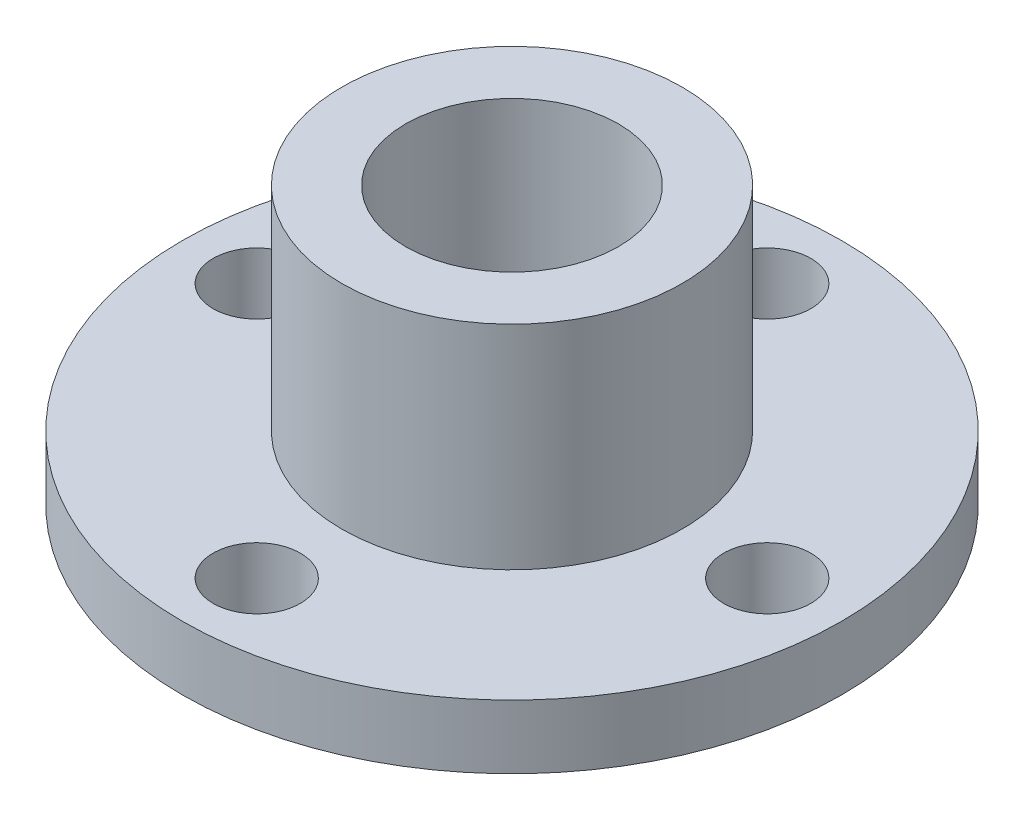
from build123d import *

# Parameters (mm, degrees)
SKETCH1_R           = 15.5
SKETCH1_R_2         = 5
SKETCH1_R_3         = 2.05
BOSS_EXTRUDE1_DEPTH = 3
SKETCH2_R           = 8
SKETCH2_R_2         = 5.003190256
BOSS_EXTRUDE2_DEPTH = 10


with BuildPart() as part:
    # Sketch1 → Boss-Extrude1 (new body)
    with BuildSketch(Plane(origin=(0, 0, 0), x_dir=(1, 0, 0), z_dir=(0, 1, 0))):
        with Locations(Location((0, 0, 0), (0, 0, 270))):
            Circle(SKETCH1_R)
        with Locations(Location((0, 0, 0), (0, 0, 270))):
            Circle(SKETCH1_R_2, mode=Mode.SUBTRACT)
        with Locations(Location((0, 12, 0), (0, 0, 270))):
            Circle(SKETCH1_R_3, mode=Mode.SUBTRACT)
        with Locations(Location((12, 0, 0), (0, 0, 270))):
            Circle(SKETCH1_R_3, mode=Mode.SUBTRACT)
        with Locations(Location((0, -12, 0), (0, 0, 270))):
            Circle(SKETCH1_R_3, mode=Mode.SUBTRACT)
        with Locations(Location((-12, 0, 0), (0, 0, 270))):
            Circle(SKETCH1_R_3, mode=Mode.SUBTRACT)
    extrude(amount=BOSS_EXTRUDE1_DEPTH)

    # Sketch2 → Boss-Extrude2 (add)
    with BuildSketch(Plane(origin=(0, 3, 0), x_dir=(1, 0, 0), z_dir=(0, 1, 0))):
        with Locations(Location((0, 0, 0), (0, 0, 270))):
            Circle(SKETCH2_R)
        with Locations(Location((0, 0, 0), (0, 0, 270))):
            Circle(SKETCH2_R_2, mode=Mode.SUBTRACT)
    extrude(amount=BOSS_EXTRUDE2_DEPTH)


solid = part.part
